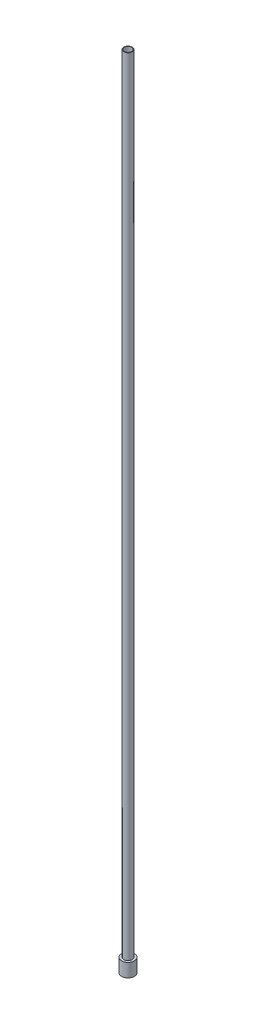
from build123d import *


with BuildPart() as part:
    # Sketch2 → Revolve1 (revolve)
    with BuildSketch(Plane.XY, mode=Mode.PRIVATE) as revolve1_sk:
        Polygon((-1.3843, 0), (-2.413, 0), (-2.413, 5.1562), (-1.5875, 5.1562), (-1.5875, 304.8), (-1.3843, 304.8), align=None)
    revolve(revolve1_sk.sketch.rotate(Axis((0, 0, 0), (0, 1, 0)), 270), axis=Axis((0, 0, 0), (0, 1, 0)))


solid = part.part
